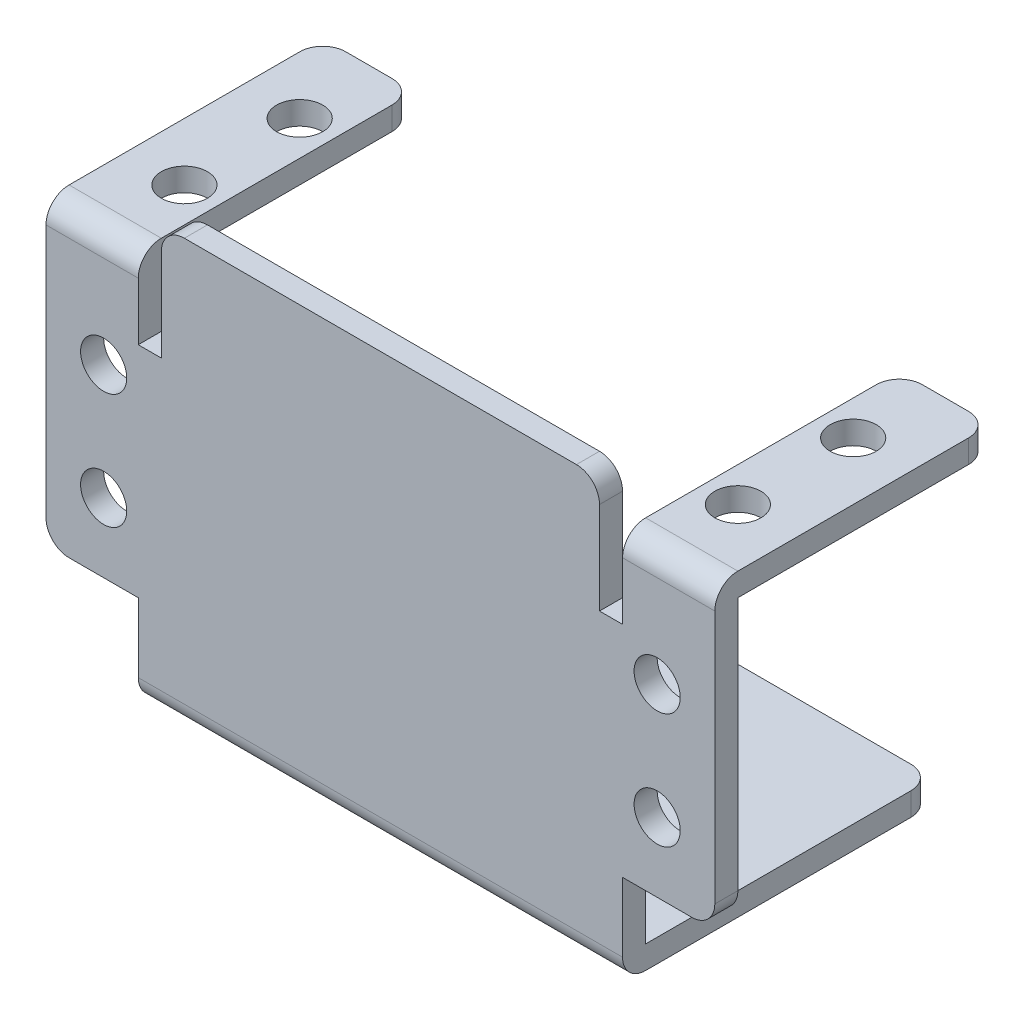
from build123d import *

# Parameters (mm, degrees)
SKETCH_1_W          = 42
SKETCH_1_H          = 25
EXTRUDE_1_DEPTH     = 2
EXTRUDE_2_DEPTH     = 2
SKETCH_3_W          = 8
SKETCH_3_H          = 24
EXTRUDE_3_DEPTH     = 2
FILLET_1_R          = 2
SKETCH_4_R          = 2
CUT_EXTRUDE_1_DEPTH = 2
SKETCH_5_R          = 2
CUT_EXTRUDE_2_DEPTH = 2


with BuildPart() as part:
    # Sketch 1 → Extrude 1 (new body)
    with BuildSketch(Plane(origin=(0, 0, 0), x_dir=(1, 0, 0), z_dir=(0, 1, 0))):
        with Locations((-44.251342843, 21.68602962)):
            Rectangle(SKETCH_1_W, SKETCH_1_H)
    extrude(amount=EXTRUDE_1_DEPTH)

    # Sketch 2 → Extrude 2 (add)
    with BuildSketch(Plane.XY.offset(-9.18602962)):
        Polygon((-23.251342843, 0), (-23.251342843, 8), (-15.251342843, 8), (-15.251342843, 32), (-23.251342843, 32), (-23.251342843, 27), (-25.251342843, 27), (-25.251342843, 37), (-44.251342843, 37), (-63.251342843, 37), (-63.251342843, 27), (-65.251342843, 27), (-65.251342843, 32), (-73.251342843, 32), (-73.251342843, 8), (-65.251342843, 8), (-65.251342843, 0), (-44.251342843, 0), align=None)
    extrude(amount=EXTRUDE_2_DEPTH)

    # Sketch 3 → Extrude 3 (add)
    with BuildSketch(Plane(origin=(0, 32, 0), x_dir=(1, 0, 0), z_dir=(0, 1, 0))):
        with Locations((-69.251342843, 19.18602962)):
            Rectangle(SKETCH_3_W, SKETCH_3_H)
        with Locations((-19.251342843, 19.18602962)):
            Rectangle(SKETCH_3_W, SKETCH_3_H)
    extrude(amount=EXTRUDE_3_DEPTH)

    # Fillet 1
    fillet_1_edges = [part.edges().sort_by_distance(p)[0] for p in [
        (-15.251342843, 8, -8.18602962),
        (-25.251342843, 37, -8.18602962),
        (-63.251342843, 37, -8.18602962),
        (-73.251342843, 8, -8.18602962),
        (-44.251342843, 0, -7.18602962),
        (-65.251342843, 33, -31.18602962),
        (-73.251342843, 33, -31.18602962),
        (-69.251342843, 34, -7.18602962),
        (-15.251342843, 33, -31.18602962),
        (-23.251342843, 33, -31.18602962),
        (-19.251342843, 34, -7.18602962),
        (-65.251342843, 1, -34.18602962),
        (-23.251342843, 1, -34.18602962),
    ]]
    fillet(fillet_1_edges, radius=FILLET_1_R)

    # Sketch 4 → Cut-Extrude 1 (cut)
    with BuildSketch(Plane(origin=(0, 34, 0), x_dir=(1, 0, 0), z_dir=(0, 1, 0))):
        with Locations(Location((-68.251342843, 24.18602962, 0), (0, 0, 270))):
            Circle(SKETCH_4_R)
        with Locations(Location((-20.251342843, 24.18602962, 0), (0, 0, 270))):
            Circle(SKETCH_4_R)
        with Locations(Location((-20.251342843, 14.18602962, 0), (0, 0, 270))):
            Circle(SKETCH_4_R)
        with Locations(Location((-68.251342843, 14.18602962, 0), (0, 0, 270))):
            Circle(SKETCH_4_R)
    extrude(amount=-CUT_EXTRUDE_1_DEPTH, mode=Mode.SUBTRACT)

    # Sketch 5 → Cut-Extrude 2 (cut)
    with BuildSketch(Plane(origin=(0, 0, -9.18602962), x_dir=(-1, 0, 0), z_dir=(0, 0, -1))):
        with Locations((68.251342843, 14)):
            Circle(SKETCH_5_R)
        with Locations((20.251342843, 14)):
            Circle(SKETCH_5_R)
        with Locations((20.251342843, 24)):
            Circle(SKETCH_5_R)
        with Locations((68.251342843, 24)):
            Circle(SKETCH_5_R)
    extrude(amount=-CUT_EXTRUDE_2_DEPTH, mode=Mode.SUBTRACT)


solid = part.part
